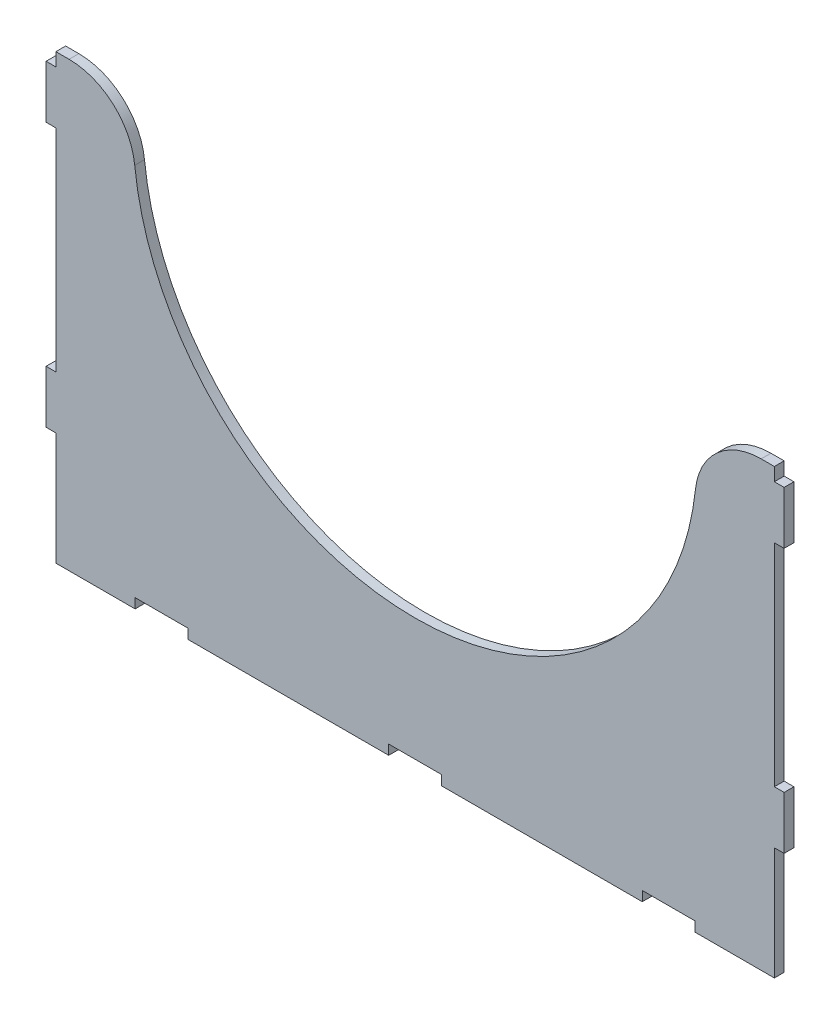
ISO-10303-21;
HEADER;
FILE_DESCRIPTION(('STEP AP214'),'2;1');
FILE_NAME('part.step','',(''),(''),'','','');
FILE_SCHEMA(('AUTOMOTIVE_DESIGN { 1 0 10303 214 1 1 1 1 }'));
ENDSEC;
DATA;
#1=APPLICATION_CONTEXT('core data for automotive mechanical design processes');
#2=APPLICATION_PROTOCOL_DEFINITION('international standard','automotive_design',2000,#1);
#3=PRODUCT_CONTEXT('',#1,'mechanical');
#4=PRODUCT('Part','Part','',(#3));
#5=PRODUCT_RELATED_PRODUCT_CATEGORY('part','',(#4));
#6=PRODUCT_DEFINITION_FORMATION('','',#4);
#7=PRODUCT_DEFINITION_CONTEXT('part definition',#1,'design');
#8=PRODUCT_DEFINITION('design','',#6,#7);
#9=PRODUCT_DEFINITION_SHAPE('','',#8);
#10=(LENGTH_UNIT() NAMED_UNIT(*) SI_UNIT(.MILLI.,.METRE.));
#11=(NAMED_UNIT(*) PLANE_ANGLE_UNIT() SI_UNIT($,.RADIAN.));
#12=(NAMED_UNIT(*) SI_UNIT($,.STERADIAN.) SOLID_ANGLE_UNIT());
#13=UNCERTAINTY_MEASURE_WITH_UNIT(LENGTH_MEASURE(1.E-05),#10,'distance_accuracy_value','');
#14=(GEOMETRIC_REPRESENTATION_CONTEXT(3) GLOBAL_UNCERTAINTY_ASSIGNED_CONTEXT((#13)) GLOBAL_UNIT_ASSIGNED_CONTEXT((#10,
#11,#12)) REPRESENTATION_CONTEXT('',''));
#15=CARTESIAN_POINT('',(0.,0.,0.));
#16=DIRECTION('',(0.,0.,1.));
#17=DIRECTION('',(1.,0.,0.));
#18=AXIS2_PLACEMENT_3D('',#15,#16,#17);
#19=CARTESIAN_POINT('',(-136.,0.,3.7));
#20=DIRECTION('',(1.,0.,0.));
#21=DIRECTION('',(0.,0.,-1.));
#22=AXIS2_PLACEMENT_3D('',#19,#20,#21);
#23=PLANE('',#22);
#24=DIRECTION('',(0.,-1.,0.));
#25=VECTOR('',#24,1.);
#26=CARTESIAN_POINT('',(-136.,0.,0.));
#27=LINE('',#26,#25);
#28=CARTESIAN_POINT('',(-136.,42.7,0.));
#29=VERTEX_POINT('',#28);
#30=CARTESIAN_POINT('',(-136.,0.,0.));
#31=VERTEX_POINT('',#30);
#32=EDGE_CURVE('E297',#29,#31,#27,.T.);
#33=ORIENTED_EDGE('',*,*,#32,.T.);
#34=DIRECTION('',(0.,0.,-1.));
#35=VECTOR('',#34,1.);
#36=CARTESIAN_POINT('',(-136.,0.,3.7));
#37=LINE('',#36,#35);
#38=CARTESIAN_POINT('',(-136.,0.,3.7));
#39=VERTEX_POINT('',#38);
#40=EDGE_CURVE('E11',#39,#31,#37,.T.);
#41=ORIENTED_EDGE('',*,*,#40,.F.);
#42=DIRECTION('',(0.,-1.,0.));
#43=VECTOR('',#42,1.);
#44=CARTESIAN_POINT('',(-136.,0.,3.7));
#45=LINE('',#44,#43);
#46=CARTESIAN_POINT('',(-136.,42.7,3.7));
#47=VERTEX_POINT('',#46);
#48=EDGE_CURVE('E367',#47,#39,#45,.T.);
#49=ORIENTED_EDGE('',*,*,#48,.F.);
#50=DIRECTION('',(0.,0.,-1.));
#51=VECTOR('',#50,1.);
#52=CARTESIAN_POINT('',(-136.,42.7,3.7));
#53=LINE('',#52,#51);
#54=EDGE_CURVE('E293',#47,#29,#53,.T.);
#55=ORIENTED_EDGE('',*,*,#54,.T.);
#56=EDGE_LOOP('',(#33,#41,#49,#55));
#57=FACE_BOUND('',#56,.T.);
#58=ADVANCED_FACE('F33',(#57),#23,.F.);
#59=CARTESIAN_POINT('',(-136.,0.,3.7));
#60=DIRECTION('',(0.,1.,0.));
#61=DIRECTION('',(0.,0.,1.));
#62=AXIS2_PLACEMENT_3D('',#59,#60,#61);
#63=PLANE('',#62);
#64=DIRECTION('',(1.,0.,0.));
#65=VECTOR('',#64,1.);
#66=CARTESIAN_POINT('',(-136.,0.,0.));
#67=LINE('',#66,#65);
#68=CARTESIAN_POINT('',(-106.,0.,0.));
#69=VERTEX_POINT('',#68);
#70=EDGE_CURVE('E300',#31,#69,#67,.T.);
#71=ORIENTED_EDGE('',*,*,#70,.T.);
#72=DIRECTION('',(0.,0.,-1.));
#73=VECTOR('',#72,1.);
#74=CARTESIAN_POINT('',(-106.,0.,3.7));
#75=LINE('',#74,#73);
#76=CARTESIAN_POINT('',(-106.,0.,3.7));
#77=VERTEX_POINT('',#76);
#78=EDGE_CURVE('E41',#77,#69,#75,.T.);
#79=ORIENTED_EDGE('',*,*,#78,.F.);
#80=DIRECTION('',(1.,0.,0.));
#81=VECTOR('',#80,1.);
#82=CARTESIAN_POINT('',(-136.,0.,3.7));
#83=LINE('',#82,#81);
#84=EDGE_CURVE('E176',#39,#77,#83,.T.);
#85=ORIENTED_EDGE('',*,*,#84,.F.);
#86=ORIENTED_EDGE('',*,*,#40,.T.);
#87=EDGE_LOOP('',(#71,#79,#85,#86));
#88=FACE_BOUND('',#87,.T.);
#89=ADVANCED_FACE('F565',(#88),#63,.F.);
#90=CARTESIAN_POINT('',(-106.,0.,3.7));
#91=DIRECTION('',(-1.,0.,0.));
#92=DIRECTION('',(0.,0.,1.));
#93=AXIS2_PLACEMENT_3D('',#90,#91,#92);
#94=PLANE('',#93);
#95=DIRECTION('',(0.,1.,0.));
#96=VECTOR('',#95,1.);
#97=CARTESIAN_POINT('',(-106.,0.,0.));
#98=LINE('',#97,#96);
#99=CARTESIAN_POINT('',(-106.,3.7,0.));
#100=VERTEX_POINT('',#99);
#101=EDGE_CURVE('E302',#69,#100,#98,.T.);
#102=ORIENTED_EDGE('',*,*,#101,.T.);
#103=DIRECTION('',(0.,0.,-1.));
#104=VECTOR('',#103,1.);
#105=CARTESIAN_POINT('',(-106.,3.7,3.7));
#106=LINE('',#105,#104);
#107=CARTESIAN_POINT('',(-106.,3.7,3.7));
#108=VERTEX_POINT('',#107);
#109=EDGE_CURVE('E458',#108,#100,#106,.T.);
#110=ORIENTED_EDGE('',*,*,#109,.F.);
#111=DIRECTION('',(0.,1.,0.));
#112=VECTOR('',#111,1.);
#113=CARTESIAN_POINT('',(-106.,0.,3.7));
#114=LINE('',#113,#112);
#115=EDGE_CURVE('E466',#77,#108,#114,.T.);
#116=ORIENTED_EDGE('',*,*,#115,.F.);
#117=ORIENTED_EDGE('',*,*,#78,.T.);
#118=EDGE_LOOP('',(#102,#110,#116,#117));
#119=FACE_BOUND('',#118,.T.);
#120=ADVANCED_FACE('F464',(#119),#94,.F.);
#121=CARTESIAN_POINT('',(-106.,3.7,3.7));
#122=DIRECTION('',(0.,1.,0.));
#123=DIRECTION('',(0.,0.,1.));
#124=AXIS2_PLACEMENT_3D('',#121,#122,#123);
#125=PLANE('',#124);
#126=DIRECTION('',(1.,0.,0.));
#127=VECTOR('',#126,1.);
#128=CARTESIAN_POINT('',(-106.,3.7,0.));
#129=LINE('',#128,#127);
#130=CARTESIAN_POINT('',(-86.,3.7,0.));
#131=VERTEX_POINT('',#130);
#132=EDGE_CURVE('E304',#100,#131,#129,.T.);
#133=ORIENTED_EDGE('',*,*,#132,.T.);
#134=DIRECTION('',(0.,0.,-1.));
#135=VECTOR('',#134,1.);
#136=CARTESIAN_POINT('',(-86.,3.7,3.7));
#137=LINE('',#136,#135);
#138=CARTESIAN_POINT('',(-86.,3.7,3.7));
#139=VERTEX_POINT('',#138);
#140=EDGE_CURVE('E455',#139,#131,#137,.T.);
#141=ORIENTED_EDGE('',*,*,#140,.F.);
#142=DIRECTION('',(1.,0.,0.));
#143=VECTOR('',#142,1.);
#144=CARTESIAN_POINT('',(-106.,3.7,3.7));
#145=LINE('',#144,#143);
#146=EDGE_CURVE('E484',#108,#139,#145,.T.);
#147=ORIENTED_EDGE('',*,*,#146,.F.);
#148=ORIENTED_EDGE('',*,*,#109,.T.);
#149=EDGE_LOOP('',(#133,#141,#147,#148));
#150=FACE_BOUND('',#149,.T.);
#151=ADVANCED_FACE('F475',(#150),#125,.F.);
#152=CARTESIAN_POINT('',(-86.,0.,3.7));
#153=DIRECTION('',(1.,0.,0.));
#154=DIRECTION('',(0.,0.,-1.));
#155=AXIS2_PLACEMENT_3D('',#152,#153,#154);
#156=PLANE('',#155);
#157=DIRECTION('',(0.,-1.,0.));
#158=VECTOR('',#157,1.);
#159=CARTESIAN_POINT('',(-86.,0.,0.));
#160=LINE('',#159,#158);
#161=CARTESIAN_POINT('',(-86.,0.,0.));
#162=VERTEX_POINT('',#161);
#163=EDGE_CURVE('E306',#131,#162,#160,.T.);
#164=ORIENTED_EDGE('',*,*,#163,.T.);
#165=DIRECTION('',(0.,0.,-1.));
#166=VECTOR('',#165,1.);
#167=CARTESIAN_POINT('',(-86.,0.,3.7));
#168=LINE('',#167,#166);
#169=CARTESIAN_POINT('',(-86.,0.,3.7));
#170=VERTEX_POINT('',#169);
#171=EDGE_CURVE('E452',#170,#162,#168,.T.);
#172=ORIENTED_EDGE('',*,*,#171,.F.);
#173=DIRECTION('',(0.,-1.,0.));
#174=VECTOR('',#173,1.);
#175=CARTESIAN_POINT('',(-86.,0.,3.7));
#176=LINE('',#175,#174);
#177=EDGE_CURVE('E481',#139,#170,#176,.T.);
#178=ORIENTED_EDGE('',*,*,#177,.F.);
#179=ORIENTED_EDGE('',*,*,#140,.T.);
#180=EDGE_LOOP('',(#164,#172,#178,#179));
#181=FACE_BOUND('',#180,.T.);
#182=ADVANCED_FACE('F479',(#181),#156,.F.);
#183=CARTESIAN_POINT('',(-10.,0.,3.7));
#184=DIRECTION('',(0.,1.,0.));
#185=DIRECTION('',(-1.,0.,0.));
#186=AXIS2_PLACEMENT_3D('',#183,#184,#185);
#187=PLANE('',#186);
#188=DIRECTION('',(1.,0.,0.));
#189=VECTOR('',#188,1.);
#190=CARTESIAN_POINT('',(-10.,0.,0.));
#191=LINE('',#190,#189);
#192=CARTESIAN_POINT('',(-10.,0.,0.));
#193=VERTEX_POINT('',#192);
#194=EDGE_CURVE('E308',#162,#193,#191,.T.);
#195=ORIENTED_EDGE('',*,*,#194,.T.);
#196=DIRECTION('',(0.,0.,-1.));
#197=VECTOR('',#196,1.);
#198=CARTESIAN_POINT('',(-10.,0.,3.7));
#199=LINE('',#198,#197);
#200=CARTESIAN_POINT('',(-10.,0.,3.7));
#201=VERTEX_POINT('',#200);
#202=EDGE_CURVE('E449',#201,#193,#199,.T.);
#203=ORIENTED_EDGE('',*,*,#202,.F.);
#204=DIRECTION('',(1.,0.,0.));
#205=VECTOR('',#204,1.);
#206=CARTESIAN_POINT('',(-10.,0.,3.7));
#207=LINE('',#206,#205);
#208=EDGE_CURVE('E483',#170,#201,#207,.T.);
#209=ORIENTED_EDGE('',*,*,#208,.F.);
#210=ORIENTED_EDGE('',*,*,#171,.T.);
#211=EDGE_LOOP('',(#195,#203,#209,#210));
#212=FACE_BOUND('',#211,.T.);
#213=ADVANCED_FACE('F578',(#212),#187,.F.);
#214=CARTESIAN_POINT('',(-10.,0.,3.7));
#215=DIRECTION('',(-1.,0.,0.));
#216=DIRECTION('',(0.,0.,1.));
#217=AXIS2_PLACEMENT_3D('',#214,#215,#216);
#218=PLANE('',#217);
#219=DIRECTION('',(0.,1.,0.));
#220=VECTOR('',#219,1.);
#221=CARTESIAN_POINT('',(-10.,0.,0.));
#222=LINE('',#221,#220);
#223=CARTESIAN_POINT('',(-10.,3.7,0.));
#224=VERTEX_POINT('',#223);
#225=EDGE_CURVE('E310',#193,#224,#222,.T.);
#226=ORIENTED_EDGE('',*,*,#225,.T.);
#227=DIRECTION('',(0.,0.,-1.));
#228=VECTOR('',#227,1.);
#229=CARTESIAN_POINT('',(-10.,3.7,3.7));
#230=LINE('',#229,#228);
#231=CARTESIAN_POINT('',(-10.,3.7,3.7));
#232=VERTEX_POINT('',#231);
#233=EDGE_CURVE('E446',#232,#224,#230,.T.);
#234=ORIENTED_EDGE('',*,*,#233,.F.);
#235=DIRECTION('',(0.,1.,0.));
#236=VECTOR('',#235,1.);
#237=CARTESIAN_POINT('',(-10.,0.,3.7));
#238=LINE('',#237,#236);
#239=EDGE_CURVE('E486',#201,#232,#238,.T.);
#240=ORIENTED_EDGE('',*,*,#239,.F.);
#241=ORIENTED_EDGE('',*,*,#202,.T.);
#242=EDGE_LOOP('',(#226,#234,#240,#241));
#243=FACE_BOUND('',#242,.T.);
#244=ADVANCED_FACE('F581',(#243),#218,.F.);
#245=CARTESIAN_POINT('',(-10.,3.7,3.7));
#246=DIRECTION('',(0.,1.,0.));
#247=DIRECTION('',(0.,0.,1.));
#248=AXIS2_PLACEMENT_3D('',#245,#246,#247);
#249=PLANE('',#248);
#250=DIRECTION('',(1.,0.,0.));
#251=VECTOR('',#250,1.);
#252=CARTESIAN_POINT('',(-10.,3.7,0.));
#253=LINE('',#252,#251);
#254=CARTESIAN_POINT('',(10.,3.7,0.));
#255=VERTEX_POINT('',#254);
#256=EDGE_CURVE('E312',#224,#255,#253,.T.);
#257=ORIENTED_EDGE('',*,*,#256,.T.);
#258=DIRECTION('',(0.,0.,-1.));
#259=VECTOR('',#258,1.);
#260=CARTESIAN_POINT('',(10.,3.7,3.7));
#261=LINE('',#260,#259);
#262=CARTESIAN_POINT('',(10.,3.7,3.7));
#263=VERTEX_POINT('',#262);
#264=EDGE_CURVE('E443',#263,#255,#261,.T.);
#265=ORIENTED_EDGE('',*,*,#264,.F.);
#266=DIRECTION('',(1.,0.,0.));
#267=VECTOR('',#266,1.);
#268=CARTESIAN_POINT('',(-10.,3.7,3.7));
#269=LINE('',#268,#267);
#270=EDGE_CURVE('E492',#232,#263,#269,.T.);
#271=ORIENTED_EDGE('',*,*,#270,.F.);
#272=ORIENTED_EDGE('',*,*,#233,.T.);
#273=EDGE_LOOP('',(#257,#265,#271,#272));
#274=FACE_BOUND('',#273,.T.);
#275=ADVANCED_FACE('F585',(#274),#249,.F.);
#276=CARTESIAN_POINT('',(10.,0.,3.7));
#277=DIRECTION('',(1.,0.,0.));
#278=DIRECTION('',(0.,0.,-1.));
#279=AXIS2_PLACEMENT_3D('',#276,#277,#278);
#280=PLANE('',#279);
#281=DIRECTION('',(0.,-1.,0.));
#282=VECTOR('',#281,1.);
#283=CARTESIAN_POINT('',(10.,0.,0.));
#284=LINE('',#283,#282);
#285=CARTESIAN_POINT('',(10.,0.,0.));
#286=VERTEX_POINT('',#285);
#287=EDGE_CURVE('E314',#255,#286,#284,.T.);
#288=ORIENTED_EDGE('',*,*,#287,.T.);
#289=DIRECTION('',(0.,0.,-1.));
#290=VECTOR('',#289,1.);
#291=CARTESIAN_POINT('',(10.,0.,3.7));
#292=LINE('',#291,#290);
#293=CARTESIAN_POINT('',(10.,0.,3.7));
#294=VERTEX_POINT('',#293);
#295=EDGE_CURVE('E440',#294,#286,#292,.T.);
#296=ORIENTED_EDGE('',*,*,#295,.F.);
#297=DIRECTION('',(0.,-1.,0.));
#298=VECTOR('',#297,1.);
#299=CARTESIAN_POINT('',(10.,0.,3.7));
#300=LINE('',#299,#298);
#301=EDGE_CURVE('E494',#263,#294,#300,.T.);
#302=ORIENTED_EDGE('',*,*,#301,.F.);
#303=ORIENTED_EDGE('',*,*,#264,.T.);
#304=EDGE_LOOP('',(#288,#296,#302,#303));
#305=FACE_BOUND('',#304,.T.);
#306=ADVANCED_FACE('F589',(#305),#280,.F.);
#307=CARTESIAN_POINT('',(10.,0.,3.7));
#308=DIRECTION('',(0.,1.,0.));
#309=DIRECTION('',(-1.,0.,0.));
#310=AXIS2_PLACEMENT_3D('',#307,#308,#309);
#311=PLANE('',#310);
#312=DIRECTION('',(1.,0.,0.));
#313=VECTOR('',#312,1.);
#314=CARTESIAN_POINT('',(10.,0.,0.));
#315=LINE('',#314,#313);
#316=CARTESIAN_POINT('',(86.,0.,0.));
#317=VERTEX_POINT('',#316);
#318=EDGE_CURVE('E316',#286,#317,#315,.T.);
#319=ORIENTED_EDGE('',*,*,#318,.T.);
#320=DIRECTION('',(0.,0.,-1.));
#321=VECTOR('',#320,1.);
#322=CARTESIAN_POINT('',(86.,0.,3.7));
#323=LINE('',#322,#321);
#324=CARTESIAN_POINT('',(86.,0.,3.7));
#325=VERTEX_POINT('',#324);
#326=EDGE_CURVE('E437',#325,#317,#323,.T.);
#327=ORIENTED_EDGE('',*,*,#326,.F.);
#328=DIRECTION('',(1.,0.,0.));
#329=VECTOR('',#328,1.);
#330=CARTESIAN_POINT('',(10.,0.,3.7));
#331=LINE('',#330,#329);
#332=EDGE_CURVE('E496',#294,#325,#331,.T.);
#333=ORIENTED_EDGE('',*,*,#332,.F.);
#334=ORIENTED_EDGE('',*,*,#295,.T.);
#335=EDGE_LOOP('',(#319,#327,#333,#334));
#336=FACE_BOUND('',#335,.T.);
#337=ADVANCED_FACE('F593',(#336),#311,.F.);
#338=CARTESIAN_POINT('',(86.,0.,3.7));
#339=DIRECTION('',(-1.,0.,0.));
#340=DIRECTION('',(0.,0.,1.));
#341=AXIS2_PLACEMENT_3D('',#338,#339,#340);
#342=PLANE('',#341);
#343=DIRECTION('',(0.,1.,0.));
#344=VECTOR('',#343,1.);
#345=CARTESIAN_POINT('',(86.,0.,0.));
#346=LINE('',#345,#344);
#347=CARTESIAN_POINT('',(86.,3.7,0.));
#348=VERTEX_POINT('',#347);
#349=EDGE_CURVE('E318',#317,#348,#346,.T.);
#350=ORIENTED_EDGE('',*,*,#349,.T.);
#351=DIRECTION('',(0.,0.,-1.));
#352=VECTOR('',#351,1.);
#353=CARTESIAN_POINT('',(86.,3.7,3.7));
#354=LINE('',#353,#352);
#355=CARTESIAN_POINT('',(86.,3.7,3.7));
#356=VERTEX_POINT('',#355);
#357=EDGE_CURVE('E434',#356,#348,#354,.T.);
#358=ORIENTED_EDGE('',*,*,#357,.F.);
#359=DIRECTION('',(0.,1.,0.));
#360=VECTOR('',#359,1.);
#361=CARTESIAN_POINT('',(86.,0.,3.7));
#362=LINE('',#361,#360);
#363=EDGE_CURVE('E498',#325,#356,#362,.T.);
#364=ORIENTED_EDGE('',*,*,#363,.F.);
#365=ORIENTED_EDGE('',*,*,#326,.T.);
#366=EDGE_LOOP('',(#350,#358,#364,#365));
#367=FACE_BOUND('',#366,.T.);
#368=ADVANCED_FACE('F597',(#367),#342,.F.);
#369=CARTESIAN_POINT('',(86.,3.7,3.7));
#370=DIRECTION('',(0.,1.,0.));
#371=DIRECTION('',(0.,0.,1.));
#372=AXIS2_PLACEMENT_3D('',#369,#370,#371);
#373=PLANE('',#372);
#374=DIRECTION('',(1.,0.,0.));
#375=VECTOR('',#374,1.);
#376=CARTESIAN_POINT('',(86.,3.7,0.));
#377=LINE('',#376,#375);
#378=CARTESIAN_POINT('',(106.,3.7,0.));
#379=VERTEX_POINT('',#378);
#380=EDGE_CURVE('E320',#348,#379,#377,.T.);
#381=ORIENTED_EDGE('',*,*,#380,.T.);
#382=DIRECTION('',(0.,0.,-1.));
#383=VECTOR('',#382,1.);
#384=CARTESIAN_POINT('',(106.,3.7,3.7));
#385=LINE('',#384,#383);
#386=CARTESIAN_POINT('',(106.,3.7,3.7));
#387=VERTEX_POINT('',#386);
#388=EDGE_CURVE('E431',#387,#379,#385,.T.);
#389=ORIENTED_EDGE('',*,*,#388,.F.);
#390=DIRECTION('',(1.,0.,0.));
#391=VECTOR('',#390,1.);
#392=CARTESIAN_POINT('',(86.,3.7,3.7));
#393=LINE('',#392,#391);
#394=EDGE_CURVE('E500',#356,#387,#393,.T.);
#395=ORIENTED_EDGE('',*,*,#394,.F.);
#396=ORIENTED_EDGE('',*,*,#357,.T.);
#397=EDGE_LOOP('',(#381,#389,#395,#396));
#398=FACE_BOUND('',#397,.T.);
#399=ADVANCED_FACE('F601',(#398),#373,.F.);
#400=CARTESIAN_POINT('',(106.,0.,3.7));
#401=DIRECTION('',(1.,0.,0.));
#402=DIRECTION('',(0.,0.,-1.));
#403=AXIS2_PLACEMENT_3D('',#400,#401,#402);
#404=PLANE('',#403);
#405=DIRECTION('',(0.,-1.,0.));
#406=VECTOR('',#405,1.);
#407=CARTESIAN_POINT('',(106.,0.,0.));
#408=LINE('',#407,#406);
#409=CARTESIAN_POINT('',(106.,0.,0.));
#410=VERTEX_POINT('',#409);
#411=EDGE_CURVE('E322',#379,#410,#408,.T.);
#412=ORIENTED_EDGE('',*,*,#411,.T.);
#413=DIRECTION('',(0.,0.,-1.));
#414=VECTOR('',#413,1.);
#415=CARTESIAN_POINT('',(106.,0.,3.7));
#416=LINE('',#415,#414);
#417=CARTESIAN_POINT('',(106.,0.,3.7));
#418=VERTEX_POINT('',#417);
#419=EDGE_CURVE('E428',#418,#410,#416,.T.);
#420=ORIENTED_EDGE('',*,*,#419,.F.);
#421=DIRECTION('',(0.,-1.,0.));
#422=VECTOR('',#421,1.);
#423=CARTESIAN_POINT('',(106.,0.,3.7));
#424=LINE('',#423,#422);
#425=EDGE_CURVE('E502',#387,#418,#424,.T.);
#426=ORIENTED_EDGE('',*,*,#425,.F.);
#427=ORIENTED_EDGE('',*,*,#388,.T.);
#428=EDGE_LOOP('',(#412,#420,#426,#427));
#429=FACE_BOUND('',#428,.T.);
#430=ADVANCED_FACE('F605',(#429),#404,.F.);
#431=CARTESIAN_POINT('',(106.,0.,3.7));
#432=DIRECTION('',(0.,1.,0.));
#433=DIRECTION('',(0.,0.,1.));
#434=AXIS2_PLACEMENT_3D('',#431,#432,#433);
#435=PLANE('',#434);
#436=DIRECTION('',(1.,0.,0.));
#437=VECTOR('',#436,1.);
#438=CARTESIAN_POINT('',(106.,0.,0.));
#439=LINE('',#438,#437);
#440=CARTESIAN_POINT('',(136.,0.,0.));
#441=VERTEX_POINT('',#440);
#442=EDGE_CURVE('E324',#410,#441,#439,.T.);
#443=ORIENTED_EDGE('',*,*,#442,.T.);
#444=DIRECTION('',(0.,0.,-1.));
#445=VECTOR('',#444,1.);
#446=CARTESIAN_POINT('',(136.,0.,3.7));
#447=LINE('',#446,#445);
#448=CARTESIAN_POINT('',(136.,0.,3.7));
#449=VERTEX_POINT('',#448);
#450=EDGE_CURVE('E425',#449,#441,#447,.T.);
#451=ORIENTED_EDGE('',*,*,#450,.F.);
#452=DIRECTION('',(1.,0.,0.));
#453=VECTOR('',#452,1.);
#454=CARTESIAN_POINT('',(106.,0.,3.7));
#455=LINE('',#454,#453);
#456=EDGE_CURVE('E504',#418,#449,#455,.T.);
#457=ORIENTED_EDGE('',*,*,#456,.F.);
#458=ORIENTED_EDGE('',*,*,#419,.T.);
#459=EDGE_LOOP('',(#443,#451,#457,#458));
#460=FACE_BOUND('',#459,.T.);
#461=ADVANCED_FACE('F609',(#460),#435,.F.);
#462=CARTESIAN_POINT('',(136.,0.,3.7));
#463=DIRECTION('',(-1.,0.,0.));
#464=DIRECTION('',(0.,0.,1.));
#465=AXIS2_PLACEMENT_3D('',#462,#463,#464);
#466=PLANE('',#465);
#467=DIRECTION('',(0.,1.,0.));
#468=VECTOR('',#467,1.);
#469=CARTESIAN_POINT('',(136.,0.,0.));
#470=LINE('',#469,#468);
#471=CARTESIAN_POINT('',(136.,42.7,0.));
#472=VERTEX_POINT('',#471);
#473=EDGE_CURVE('E326',#441,#472,#470,.T.);
#474=ORIENTED_EDGE('',*,*,#473,.T.);
#475=DIRECTION('',(0.,0.,-1.));
#476=VECTOR('',#475,1.);
#477=CARTESIAN_POINT('',(136.,42.7,3.7));
#478=LINE('',#477,#476);
#479=CARTESIAN_POINT('',(136.,42.7,3.7));
#480=VERTEX_POINT('',#479);
#481=EDGE_CURVE('E422',#480,#472,#478,.T.);
#482=ORIENTED_EDGE('',*,*,#481,.F.);
#483=DIRECTION('',(0.,1.,0.));
#484=VECTOR('',#483,1.);
#485=CARTESIAN_POINT('',(136.,0.,3.7));
#486=LINE('',#485,#484);
#487=EDGE_CURVE('E506',#449,#480,#486,.T.);
#488=ORIENTED_EDGE('',*,*,#487,.F.);
#489=ORIENTED_EDGE('',*,*,#450,.T.);
#490=EDGE_LOOP('',(#474,#482,#488,#489));
#491=FACE_BOUND('',#490,.T.);
#492=ADVANCED_FACE('F613',(#491),#466,.F.);
#493=CARTESIAN_POINT('',(136.,42.7,3.7));
#494=DIRECTION('',(0.,1.,0.));
#495=DIRECTION('',(0.,0.,1.));
#496=AXIS2_PLACEMENT_3D('',#493,#494,#495);
#497=PLANE('',#496);
#498=DIRECTION('',(1.,0.,0.));
#499=VECTOR('',#498,1.);
#500=CARTESIAN_POINT('',(136.,42.7,0.));
#501=LINE('',#500,#499);
#502=CARTESIAN_POINT('',(139.7,42.7,0.));
#503=VERTEX_POINT('',#502);
#504=EDGE_CURVE('E328',#472,#503,#501,.T.);
#505=ORIENTED_EDGE('',*,*,#504,.T.);
#506=DIRECTION('',(0.,0.,-1.));
#507=VECTOR('',#506,1.);
#508=CARTESIAN_POINT('',(139.7,42.7,3.7));
#509=LINE('',#508,#507);
#510=CARTESIAN_POINT('',(139.7,42.7,3.7));
#511=VERTEX_POINT('',#510);
#512=EDGE_CURVE('E419',#511,#503,#509,.T.);
#513=ORIENTED_EDGE('',*,*,#512,.F.);
#514=DIRECTION('',(1.,0.,0.));
#515=VECTOR('',#514,1.);
#516=CARTESIAN_POINT('',(136.,42.7,3.7));
#517=LINE('',#516,#515);
#518=EDGE_CURVE('E508',#480,#511,#517,.T.);
#519=ORIENTED_EDGE('',*,*,#518,.F.);
#520=ORIENTED_EDGE('',*,*,#481,.T.);
#521=EDGE_LOOP('',(#505,#513,#519,#520));
#522=FACE_BOUND('',#521,.T.);
#523=ADVANCED_FACE('F617',(#522),#497,.F.);
#524=CARTESIAN_POINT('',(139.7,62.7,3.7));
#525=DIRECTION('',(-1.,0.,0.));
#526=DIRECTION('',(0.,-1.,0.));
#527=AXIS2_PLACEMENT_3D('',#524,#525,#526);
#528=PLANE('',#527);
#529=DIRECTION('',(0.,1.,0.));
#530=VECTOR('',#529,1.);
#531=CARTESIAN_POINT('',(139.7,62.7,0.));
#532=LINE('',#531,#530);
#533=CARTESIAN_POINT('',(139.7,62.7,0.));
#534=VERTEX_POINT('',#533);
#535=EDGE_CURVE('E330',#503,#534,#532,.T.);
#536=ORIENTED_EDGE('',*,*,#535,.T.);
#537=DIRECTION('',(0.,0.,-1.));
#538=VECTOR('',#537,1.);
#539=CARTESIAN_POINT('',(139.7,62.7,3.7));
#540=LINE('',#539,#538);
#541=CARTESIAN_POINT('',(139.7,62.7,3.7));
#542=VERTEX_POINT('',#541);
#543=EDGE_CURVE('E416',#542,#534,#540,.T.);
#544=ORIENTED_EDGE('',*,*,#543,.F.);
#545=DIRECTION('',(0.,1.,0.));
#546=VECTOR('',#545,1.);
#547=CARTESIAN_POINT('',(139.7,62.7,3.7));
#548=LINE('',#547,#546);
#549=EDGE_CURVE('E510',#511,#542,#548,.T.);
#550=ORIENTED_EDGE('',*,*,#549,.F.);
#551=ORIENTED_EDGE('',*,*,#512,.T.);
#552=EDGE_LOOP('',(#536,#544,#550,#551));
#553=FACE_BOUND('',#552,.T.);
#554=ADVANCED_FACE('F621',(#553),#528,.F.);
#555=CARTESIAN_POINT('',(136.,62.7,3.7));
#556=DIRECTION('',(0.,-1.,0.));
#557=DIRECTION('',(0.,0.,-1.));
#558=AXIS2_PLACEMENT_3D('',#555,#556,#557);
#559=PLANE('',#558);
#560=DIRECTION('',(-1.,0.,0.));
#561=VECTOR('',#560,1.);
#562=CARTESIAN_POINT('',(136.,62.7,0.));
#563=LINE('',#562,#561);
#564=CARTESIAN_POINT('',(136.,62.7,0.));
#565=VERTEX_POINT('',#564);
#566=EDGE_CURVE('E332',#534,#565,#563,.T.);
#567=ORIENTED_EDGE('',*,*,#566,.T.);
#568=DIRECTION('',(0.,0.,-1.));
#569=VECTOR('',#568,1.);
#570=CARTESIAN_POINT('',(136.,62.7,3.7));
#571=LINE('',#570,#569);
#572=CARTESIAN_POINT('',(136.,62.7,3.7));
#573=VERTEX_POINT('',#572);
#574=EDGE_CURVE('E413',#573,#565,#571,.T.);
#575=ORIENTED_EDGE('',*,*,#574,.F.);
#576=DIRECTION('',(-1.,0.,0.));
#577=VECTOR('',#576,1.);
#578=CARTESIAN_POINT('',(136.,62.7,3.7));
#579=LINE('',#578,#577);
#580=EDGE_CURVE('E512',#542,#573,#579,.T.);
#581=ORIENTED_EDGE('',*,*,#580,.F.);
#582=ORIENTED_EDGE('',*,*,#543,.T.);
#583=EDGE_LOOP('',(#567,#575,#581,#582));
#584=FACE_BOUND('',#583,.T.);
#585=ADVANCED_FACE('F625',(#584),#559,.F.);
#586=CARTESIAN_POINT('',(136.,62.7,3.7));
#587=DIRECTION('',(-1.,0.,0.));
#588=DIRECTION('',(0.,0.,1.));
#589=AXIS2_PLACEMENT_3D('',#586,#587,#588);
#590=PLANE('',#589);
#591=DIRECTION('',(0.,1.,0.));
#592=VECTOR('',#591,1.);
#593=CARTESIAN_POINT('',(136.,62.7,0.));
#594=LINE('',#593,#592);
#595=CARTESIAN_POINT('',(136.,142.7,0.));
#596=VERTEX_POINT('',#595);
#597=EDGE_CURVE('E334',#565,#596,#594,.T.);
#598=ORIENTED_EDGE('',*,*,#597,.T.);
#599=DIRECTION('',(0.,0.,-1.));
#600=VECTOR('',#599,1.);
#601=CARTESIAN_POINT('',(136.,142.7,3.7));
#602=LINE('',#601,#600);
#603=CARTESIAN_POINT('',(136.,142.7,3.7));
#604=VERTEX_POINT('',#603);
#605=EDGE_CURVE('E410',#604,#596,#602,.T.);
#606=ORIENTED_EDGE('',*,*,#605,.F.);
#607=DIRECTION('',(0.,1.,0.));
#608=VECTOR('',#607,1.);
#609=CARTESIAN_POINT('',(136.,62.7,3.7));
#610=LINE('',#609,#608);
#611=EDGE_CURVE('E514',#573,#604,#610,.T.);
#612=ORIENTED_EDGE('',*,*,#611,.F.);
#613=ORIENTED_EDGE('',*,*,#574,.T.);
#614=EDGE_LOOP('',(#598,#606,#612,#613));
#615=FACE_BOUND('',#614,.T.);
#616=ADVANCED_FACE('F629',(#615),#590,.F.);
#617=CARTESIAN_POINT('',(139.7,142.7,3.7));
#618=DIRECTION('',(0.,1.,0.));
#619=DIRECTION('',(0.,0.,1.));
#620=AXIS2_PLACEMENT_3D('',#617,#618,#619);
#621=PLANE('',#620);
#622=DIRECTION('',(1.,0.,0.));
#623=VECTOR('',#622,1.);
#624=CARTESIAN_POINT('',(139.7,142.7,0.));
#625=LINE('',#624,#623);
#626=CARTESIAN_POINT('',(139.7,142.7,0.));
#627=VERTEX_POINT('',#626);
#628=EDGE_CURVE('E336',#596,#627,#625,.T.);
#629=ORIENTED_EDGE('',*,*,#628,.T.);
#630=DIRECTION('',(0.,0.,-1.));
#631=VECTOR('',#630,1.);
#632=CARTESIAN_POINT('',(139.7,142.7,3.7));
#633=LINE('',#632,#631);
#634=CARTESIAN_POINT('',(139.7,142.7,3.7));
#635=VERTEX_POINT('',#634);
#636=EDGE_CURVE('E407',#635,#627,#633,.T.);
#637=ORIENTED_EDGE('',*,*,#636,.F.);
#638=DIRECTION('',(1.,0.,0.));
#639=VECTOR('',#638,1.);
#640=CARTESIAN_POINT('',(139.7,142.7,3.7));
#641=LINE('',#640,#639);
#642=EDGE_CURVE('E516',#604,#635,#641,.T.);
#643=ORIENTED_EDGE('',*,*,#642,.F.);
#644=ORIENTED_EDGE('',*,*,#605,.T.);
#645=EDGE_LOOP('',(#629,#637,#643,#644));
#646=FACE_BOUND('',#645,.T.);
#647=ADVANCED_FACE('F633',(#646),#621,.F.);
#648=CARTESIAN_POINT('',(139.7,162.7,3.7));
#649=DIRECTION('',(-1.,0.,0.));
#650=DIRECTION('',(0.,-1.,0.));
#651=AXIS2_PLACEMENT_3D('',#648,#649,#650);
#652=PLANE('',#651);
#653=DIRECTION('',(0.,1.,0.));
#654=VECTOR('',#653,1.);
#655=CARTESIAN_POINT('',(139.7,162.7,0.));
#656=LINE('',#655,#654);
#657=CARTESIAN_POINT('',(139.7,162.7,0.));
#658=VERTEX_POINT('',#657);
#659=EDGE_CURVE('E338',#627,#658,#656,.T.);
#660=ORIENTED_EDGE('',*,*,#659,.T.);
#661=DIRECTION('',(0.,0.,-1.));
#662=VECTOR('',#661,1.);
#663=CARTESIAN_POINT('',(139.7,162.7,3.7));
#664=LINE('',#663,#662);
#665=CARTESIAN_POINT('',(139.7,162.7,3.7));
#666=VERTEX_POINT('',#665);
#667=EDGE_CURVE('E404',#666,#658,#664,.T.);
#668=ORIENTED_EDGE('',*,*,#667,.F.);
#669=DIRECTION('',(0.,1.,0.));
#670=VECTOR('',#669,1.);
#671=CARTESIAN_POINT('',(139.7,162.7,3.7));
#672=LINE('',#671,#670);
#673=EDGE_CURVE('E518',#635,#666,#672,.T.);
#674=ORIENTED_EDGE('',*,*,#673,.F.);
#675=ORIENTED_EDGE('',*,*,#636,.T.);
#676=EDGE_LOOP('',(#660,#668,#674,#675));
#677=FACE_BOUND('',#676,.T.);
#678=ADVANCED_FACE('F637',(#677),#652,.F.);
#679=CARTESIAN_POINT('',(139.7,162.7,3.7));
#680=DIRECTION('',(0.,-1.,0.));
#681=DIRECTION('',(0.,0.,-1.));
#682=AXIS2_PLACEMENT_3D('',#679,#680,#681);
#683=PLANE('',#682);
#684=DIRECTION('',(-1.,0.,0.));
#685=VECTOR('',#684,1.);
#686=CARTESIAN_POINT('',(139.7,162.7,0.));
#687=LINE('',#686,#685);
#688=CARTESIAN_POINT('',(136.,162.7,0.));
#689=VERTEX_POINT('',#688);
#690=EDGE_CURVE('E340',#658,#689,#687,.T.);
#691=ORIENTED_EDGE('',*,*,#690,.T.);
#692=DIRECTION('',(0.,0.,-1.));
#693=VECTOR('',#692,1.);
#694=CARTESIAN_POINT('',(136.,162.7,3.7));
#695=LINE('',#694,#693);
#696=CARTESIAN_POINT('',(136.,162.7,3.7));
#697=VERTEX_POINT('',#696);
#698=EDGE_CURVE('E401',#697,#689,#695,.T.);
#699=ORIENTED_EDGE('',*,*,#698,.F.);
#700=DIRECTION('',(-1.,0.,0.));
#701=VECTOR('',#700,1.);
#702=CARTESIAN_POINT('',(139.7,162.7,3.7));
#703=LINE('',#702,#701);
#704=EDGE_CURVE('E520',#666,#697,#703,.T.);
#705=ORIENTED_EDGE('',*,*,#704,.F.);
#706=ORIENTED_EDGE('',*,*,#667,.T.);
#707=EDGE_LOOP('',(#691,#699,#705,#706));
#708=FACE_BOUND('',#707,.T.);
#709=ADVANCED_FACE('F641',(#708),#683,.F.);
#710=CARTESIAN_POINT('',(136.,162.7,3.7));
#711=DIRECTION('',(-1.,0.,0.));
#712=DIRECTION('',(0.,0.,1.));
#713=AXIS2_PLACEMENT_3D('',#710,#711,#712);
#714=PLANE('',#713);
#715=DIRECTION('',(0.,1.,0.));
#716=VECTOR('',#715,1.);
#717=CARTESIAN_POINT('',(136.,162.7,0.));
#718=LINE('',#717,#716);
#719=CARTESIAN_POINT('',(136.,167.7,0.));
#720=VERTEX_POINT('',#719);
#721=EDGE_CURVE('E342',#689,#720,#718,.T.);
#722=ORIENTED_EDGE('',*,*,#721,.T.);
#723=DIRECTION('',(0.,0.,-1.));
#724=VECTOR('',#723,1.);
#725=CARTESIAN_POINT('',(136.,167.7,3.7));
#726=LINE('',#725,#724);
#727=CARTESIAN_POINT('',(136.,167.7,3.7));
#728=VERTEX_POINT('',#727);
#729=EDGE_CURVE('E398',#728,#720,#726,.T.);
#730=ORIENTED_EDGE('',*,*,#729,.F.);
#731=DIRECTION('',(0.,1.,0.));
#732=VECTOR('',#731,1.);
#733=CARTESIAN_POINT('',(136.,162.7,3.7));
#734=LINE('',#733,#732);
#735=EDGE_CURVE('E522',#697,#728,#734,.T.);
#736=ORIENTED_EDGE('',*,*,#735,.F.);
#737=ORIENTED_EDGE('',*,*,#698,.T.);
#738=EDGE_LOOP('',(#722,#730,#736,#737));
#739=FACE_BOUND('',#738,.T.);
#740=ADVANCED_FACE('F645',(#739),#714,.F.);
#741=CARTESIAN_POINT('',(131.,167.7,3.7));
#742=DIRECTION('',(0.,-1.,0.));
#743=DIRECTION('',(0.,0.,-1.));
#744=AXIS2_PLACEMENT_3D('',#741,#742,#743);
#745=PLANE('',#744);
#746=DIRECTION('',(-1.,0.,0.));
#747=VECTOR('',#746,1.);
#748=CARTESIAN_POINT('',(131.,167.7,0.));
#749=LINE('',#748,#747);
#750=CARTESIAN_POINT('',(131.,167.7,0.));
#751=VERTEX_POINT('',#750);
#752=EDGE_CURVE('E344',#720,#751,#749,.T.);
#753=ORIENTED_EDGE('',*,*,#752,.T.);
#754=DIRECTION('',(0.,0.,-1.));
#755=VECTOR('',#754,1.);
#756=CARTESIAN_POINT('',(131.,167.7,3.7));
#757=LINE('',#756,#755);
#758=CARTESIAN_POINT('',(131.,167.7,3.7));
#759=VERTEX_POINT('',#758);
#760=EDGE_CURVE('E395',#759,#751,#757,.T.);
#761=ORIENTED_EDGE('',*,*,#760,.F.);
#762=DIRECTION('',(-1.,0.,0.));
#763=VECTOR('',#762,1.);
#764=CARTESIAN_POINT('',(131.,167.7,3.7));
#765=LINE('',#764,#763);
#766=EDGE_CURVE('E524',#728,#759,#765,.T.);
#767=ORIENTED_EDGE('',*,*,#766,.F.);
#768=ORIENTED_EDGE('',*,*,#729,.T.);
#769=EDGE_LOOP('',(#753,#761,#767,#768));
#770=FACE_BOUND('',#769,.T.);
#771=ADVANCED_FACE('F649',(#770),#745,.F.);
#772=CARTESIAN_POINT('',(131.,142.7,3.7));
#773=DIRECTION('',(0.,0.,-1.));
#774=DIRECTION('',(-1.,0.,0.));
#775=AXIS2_PLACEMENT_3D('',#772,#773,#774);
#776=CYLINDRICAL_SURFACE('',#775,25.);
#777=CARTESIAN_POINT('',(131.,142.7,0.));
#778=DIRECTION('',(0.,0.,1.));
#779=DIRECTION('',(1.,0.,0.));
#780=AXIS2_PLACEMENT_3D('',#777,#778,#779);
#781=CIRCLE('',#780,25.);
#782=CARTESIAN_POINT('',(106.14258749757,145.366278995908,0.));
#783=VERTEX_POINT('',#782);
#784=EDGE_CURVE('E346',#751,#783,#781,.T.);
#785=ORIENTED_EDGE('',*,*,#784,.T.);
#786=DIRECTION('',(0.,0.,-1.));
#787=VECTOR('',#786,1.);
#788=CARTESIAN_POINT('',(106.14258749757,145.366278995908,3.7));
#789=LINE('',#788,#787);
#790=CARTESIAN_POINT('',(106.14258749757,145.366278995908,3.7));
#791=VERTEX_POINT('',#790);
#792=EDGE_CURVE('E392',#791,#783,#789,.T.);
#793=ORIENTED_EDGE('',*,*,#792,.F.);
#794=CARTESIAN_POINT('',(131.,142.7,3.7));
#795=DIRECTION('',(0.,0.,1.));
#796=DIRECTION('',(1.,0.,0.));
#797=AXIS2_PLACEMENT_3D('',#794,#795,#796);
#798=CIRCLE('',#797,25.);
#799=EDGE_CURVE('E526',#759,#791,#798,.T.);
#800=ORIENTED_EDGE('',*,*,#799,.F.);
#801=ORIENTED_EDGE('',*,*,#760,.T.);
#802=EDGE_LOOP('',(#785,#793,#800,#801));
#803=FACE_BOUND('',#802,.T.);
#804=ADVANCED_FACE('F653',(#803),#776,.T.);
#805=CARTESIAN_POINT('',(0.,156.751444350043,3.7));
#806=DIRECTION('',(0.,0.,-1.));
#807=DIRECTION('',(-1.,0.,0.));
#808=AXIS2_PLACEMENT_3D('',#805,#806,#807);
#809=CYLINDRICAL_SURFACE('',#808,106.751444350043);
#810=CARTESIAN_POINT('',(0.,156.751444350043,0.));
#811=DIRECTION('',(0.,0.,-1.));
#812=DIRECTION('',(-1.,0.,0.));
#813=AXIS2_PLACEMENT_3D('',#810,#811,#812);
#814=CIRCLE('',#813,106.751444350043);
#815=CARTESIAN_POINT('',(-106.14258749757,145.366278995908,0.));
#816=VERTEX_POINT('',#815);
#817=EDGE_CURVE('E348',#783,#816,#814,.T.);
#818=ORIENTED_EDGE('',*,*,#817,.T.);
#819=DIRECTION('',(0.,0.,-1.));
#820=VECTOR('',#819,1.);
#821=CARTESIAN_POINT('',(-106.14258749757,145.366278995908,3.7));
#822=LINE('',#821,#820);
#823=CARTESIAN_POINT('',(-106.14258749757,145.366278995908,3.7));
#824=VERTEX_POINT('',#823);
#825=EDGE_CURVE('E389',#824,#816,#822,.T.);
#826=ORIENTED_EDGE('',*,*,#825,.F.);
#827=CARTESIAN_POINT('',(0.,156.751444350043,3.7));
#828=DIRECTION('',(0.,0.,-1.));
#829=DIRECTION('',(-1.,0.,0.));
#830=AXIS2_PLACEMENT_3D('',#827,#828,#829);
#831=CIRCLE('',#830,106.751444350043);
#832=EDGE_CURVE('E528',#791,#824,#831,.T.);
#833=ORIENTED_EDGE('',*,*,#832,.F.);
#834=ORIENTED_EDGE('',*,*,#792,.T.);
#835=EDGE_LOOP('',(#818,#826,#833,#834));
#836=FACE_BOUND('',#835,.T.);
#837=ADVANCED_FACE('F657',(#836),#809,.F.);
#838=CARTESIAN_POINT('',(-131.,142.7,3.7));
#839=DIRECTION('',(0.,0.,-1.));
#840=DIRECTION('',(-1.,0.,0.));
#841=AXIS2_PLACEMENT_3D('',#838,#839,#840);
#842=CYLINDRICAL_SURFACE('',#841,25.);
#843=CARTESIAN_POINT('',(-131.,142.7,0.));
#844=DIRECTION('',(0.,0.,1.));
#845=DIRECTION('',(1.,0.,0.));
#846=AXIS2_PLACEMENT_3D('',#843,#844,#845);
#847=CIRCLE('',#846,25.);
#848=CARTESIAN_POINT('',(-131.,167.7,0.));
#849=VERTEX_POINT('',#848);
#850=EDGE_CURVE('E350',#816,#849,#847,.T.);
#851=ORIENTED_EDGE('',*,*,#850,.T.);
#852=DIRECTION('',(0.,0.,-1.));
#853=VECTOR('',#852,1.);
#854=CARTESIAN_POINT('',(-131.,167.7,3.7));
#855=LINE('',#854,#853);
#856=CARTESIAN_POINT('',(-131.,167.7,3.7));
#857=VERTEX_POINT('',#856);
#858=EDGE_CURVE('E386',#857,#849,#855,.T.);
#859=ORIENTED_EDGE('',*,*,#858,.F.);
#860=CARTESIAN_POINT('',(-131.,142.7,3.7));
#861=DIRECTION('',(0.,0.,1.));
#862=DIRECTION('',(1.,0.,0.));
#863=AXIS2_PLACEMENT_3D('',#860,#861,#862);
#864=CIRCLE('',#863,25.);
#865=EDGE_CURVE('E530',#824,#857,#864,.T.);
#866=ORIENTED_EDGE('',*,*,#865,.F.);
#867=ORIENTED_EDGE('',*,*,#825,.T.);
#868=EDGE_LOOP('',(#851,#859,#866,#867));
#869=FACE_BOUND('',#868,.T.);
#870=ADVANCED_FACE('F661',(#869),#842,.T.);
#871=CARTESIAN_POINT('',(-136.,167.7,3.7));
#872=DIRECTION('',(0.,-1.,0.));
#873=DIRECTION('',(0.,0.,-1.));
#874=AXIS2_PLACEMENT_3D('',#871,#872,#873);
#875=PLANE('',#874);
#876=DIRECTION('',(-1.,0.,0.));
#877=VECTOR('',#876,1.);
#878=CARTESIAN_POINT('',(-136.,167.7,0.));
#879=LINE('',#878,#877);
#880=CARTESIAN_POINT('',(-136.,167.7,0.));
#881=VERTEX_POINT('',#880);
#882=EDGE_CURVE('E352',#849,#881,#879,.T.);
#883=ORIENTED_EDGE('',*,*,#882,.T.);
#884=DIRECTION('',(0.,0.,-1.));
#885=VECTOR('',#884,1.);
#886=CARTESIAN_POINT('',(-136.,167.7,3.7));
#887=LINE('',#886,#885);
#888=CARTESIAN_POINT('',(-136.,167.7,3.7));
#889=VERTEX_POINT('',#888);
#890=EDGE_CURVE('E383',#889,#881,#887,.T.);
#891=ORIENTED_EDGE('',*,*,#890,.F.);
#892=DIRECTION('',(-1.,0.,0.));
#893=VECTOR('',#892,1.);
#894=CARTESIAN_POINT('',(-136.,167.7,3.7));
#895=LINE('',#894,#893);
#896=EDGE_CURVE('E532',#857,#889,#895,.T.);
#897=ORIENTED_EDGE('',*,*,#896,.F.);
#898=ORIENTED_EDGE('',*,*,#858,.T.);
#899=EDGE_LOOP('',(#883,#891,#897,#898));
#900=FACE_BOUND('',#899,.T.);
#901=ADVANCED_FACE('F665',(#900),#875,.F.);
#902=CARTESIAN_POINT('',(-136.,162.7,3.7));
#903=DIRECTION('',(1.,0.,0.));
#904=DIRECTION('',(0.,0.,-1.));
#905=AXIS2_PLACEMENT_3D('',#902,#903,#904);
#906=PLANE('',#905);
#907=DIRECTION('',(0.,-1.,0.));
#908=VECTOR('',#907,1.);
#909=CARTESIAN_POINT('',(-136.,162.7,0.));
#910=LINE('',#909,#908);
#911=CARTESIAN_POINT('',(-136.,162.7,0.));
#912=VERTEX_POINT('',#911);
#913=EDGE_CURVE('E354',#881,#912,#910,.T.);
#914=ORIENTED_EDGE('',*,*,#913,.T.);
#915=DIRECTION('',(0.,0.,-1.));
#916=VECTOR('',#915,1.);
#917=CARTESIAN_POINT('',(-136.,162.7,3.7));
#918=LINE('',#917,#916);
#919=CARTESIAN_POINT('',(-136.,162.7,3.7));
#920=VERTEX_POINT('',#919);
#921=EDGE_CURVE('E380',#920,#912,#918,.T.);
#922=ORIENTED_EDGE('',*,*,#921,.F.);
#923=DIRECTION('',(0.,-1.,0.));
#924=VECTOR('',#923,1.);
#925=CARTESIAN_POINT('',(-136.,162.7,3.7));
#926=LINE('',#925,#924);
#927=EDGE_CURVE('E534',#889,#920,#926,.T.);
#928=ORIENTED_EDGE('',*,*,#927,.F.);
#929=ORIENTED_EDGE('',*,*,#890,.T.);
#930=EDGE_LOOP('',(#914,#922,#928,#929));
#931=FACE_BOUND('',#930,.T.);
#932=ADVANCED_FACE('F669',(#931),#906,.F.);
#933=CARTESIAN_POINT('',(-136.,162.7,3.7));
#934=DIRECTION('',(0.,-1.,0.));
#935=DIRECTION('',(0.,0.,-1.));
#936=AXIS2_PLACEMENT_3D('',#933,#934,#935);
#937=PLANE('',#936);
#938=DIRECTION('',(-1.,0.,0.));
#939=VECTOR('',#938,1.);
#940=CARTESIAN_POINT('',(-136.,162.7,0.));
#941=LINE('',#940,#939);
#942=CARTESIAN_POINT('',(-139.7,162.7,0.));
#943=VERTEX_POINT('',#942);
#944=EDGE_CURVE('E356',#912,#943,#941,.T.);
#945=ORIENTED_EDGE('',*,*,#944,.T.);
#946=DIRECTION('',(0.,0.,-1.));
#947=VECTOR('',#946,1.);
#948=CARTESIAN_POINT('',(-139.7,162.7,3.7));
#949=LINE('',#948,#947);
#950=CARTESIAN_POINT('',(-139.7,162.7,3.7));
#951=VERTEX_POINT('',#950);
#952=EDGE_CURVE('E377',#951,#943,#949,.T.);
#953=ORIENTED_EDGE('',*,*,#952,.F.);
#954=DIRECTION('',(-1.,0.,0.));
#955=VECTOR('',#954,1.);
#956=CARTESIAN_POINT('',(-136.,162.7,3.7));
#957=LINE('',#956,#955);
#958=EDGE_CURVE('E536',#920,#951,#957,.T.);
#959=ORIENTED_EDGE('',*,*,#958,.F.);
#960=ORIENTED_EDGE('',*,*,#921,.T.);
#961=EDGE_LOOP('',(#945,#953,#959,#960));
#962=FACE_BOUND('',#961,.T.);
#963=ADVANCED_FACE('F673',(#962),#937,.F.);
#964=CARTESIAN_POINT('',(-139.7,162.7,3.7));
#965=DIRECTION('',(1.,0.,0.));
#966=DIRECTION('',(0.,1.,0.));
#967=AXIS2_PLACEMENT_3D('',#964,#965,#966);
#968=PLANE('',#967);
#969=DIRECTION('',(0.,-1.,0.));
#970=VECTOR('',#969,1.);
#971=CARTESIAN_POINT('',(-139.7,162.7,0.));
#972=LINE('',#971,#970);
#973=CARTESIAN_POINT('',(-139.7,142.7,0.));
#974=VERTEX_POINT('',#973);
#975=EDGE_CURVE('E358',#943,#974,#972,.T.);
#976=ORIENTED_EDGE('',*,*,#975,.T.);
#977=DIRECTION('',(0.,0.,-1.));
#978=VECTOR('',#977,1.);
#979=CARTESIAN_POINT('',(-139.7,142.7,3.7));
#980=LINE('',#979,#978);
#981=CARTESIAN_POINT('',(-139.7,142.7,3.7));
#982=VERTEX_POINT('',#981);
#983=EDGE_CURVE('E374',#982,#974,#980,.T.);
#984=ORIENTED_EDGE('',*,*,#983,.F.);
#985=DIRECTION('',(0.,-1.,0.));
#986=VECTOR('',#985,1.);
#987=CARTESIAN_POINT('',(-139.7,162.7,3.7));
#988=LINE('',#987,#986);
#989=EDGE_CURVE('E538',#951,#982,#988,.T.);
#990=ORIENTED_EDGE('',*,*,#989,.F.);
#991=ORIENTED_EDGE('',*,*,#952,.T.);
#992=EDGE_LOOP('',(#976,#984,#990,#991));
#993=FACE_BOUND('',#992,.T.);
#994=ADVANCED_FACE('F677',(#993),#968,.F.);
#995=CARTESIAN_POINT('',(-136.,142.7,3.7));
#996=DIRECTION('',(0.,1.,0.));
#997=DIRECTION('',(0.,0.,1.));
#998=AXIS2_PLACEMENT_3D('',#995,#996,#997);
#999=PLANE('',#998);
#1000=DIRECTION('',(1.,0.,0.));
#1001=VECTOR('',#1000,1.);
#1002=CARTESIAN_POINT('',(-136.,142.7,0.));
#1003=LINE('',#1002,#1001);
#1004=CARTESIAN_POINT('',(-136.,142.7,0.));
#1005=VERTEX_POINT('',#1004);
#1006=EDGE_CURVE('E360',#974,#1005,#1003,.T.);
#1007=ORIENTED_EDGE('',*,*,#1006,.T.);
#1008=DIRECTION('',(0.,0.,-1.));
#1009=VECTOR('',#1008,1.);
#1010=CARTESIAN_POINT('',(-136.,142.7,3.7));
#1011=LINE('',#1010,#1009);
#1012=CARTESIAN_POINT('',(-136.,142.7,3.7));
#1013=VERTEX_POINT('',#1012);
#1014=EDGE_CURVE('E371',#1013,#1005,#1011,.T.);
#1015=ORIENTED_EDGE('',*,*,#1014,.F.);
#1016=DIRECTION('',(1.,0.,0.));
#1017=VECTOR('',#1016,1.);
#1018=CARTESIAN_POINT('',(-136.,142.7,3.7));
#1019=LINE('',#1018,#1017);
#1020=EDGE_CURVE('E540',#982,#1013,#1019,.T.);
#1021=ORIENTED_EDGE('',*,*,#1020,.F.);
#1022=ORIENTED_EDGE('',*,*,#983,.T.);
#1023=EDGE_LOOP('',(#1007,#1015,#1021,#1022));
#1024=FACE_BOUND('',#1023,.T.);
#1025=ADVANCED_FACE('F546',(#1024),#999,.F.);
#1026=CARTESIAN_POINT('',(-136.,62.7,3.7));
#1027=DIRECTION('',(1.,0.,0.));
#1028=DIRECTION('',(0.,0.,-1.));
#1029=AXIS2_PLACEMENT_3D('',#1026,#1027,#1028);
#1030=PLANE('',#1029);
#1031=DIRECTION('',(0.,-1.,0.));
#1032=VECTOR('',#1031,1.);
#1033=CARTESIAN_POINT('',(-136.,62.7,0.));
#1034=LINE('',#1033,#1032);
#1035=CARTESIAN_POINT('',(-136.,62.7,0.));
#1036=VERTEX_POINT('',#1035);
#1037=EDGE_CURVE('E362',#1005,#1036,#1034,.T.);
#1038=ORIENTED_EDGE('',*,*,#1037,.T.);
#1039=DIRECTION('',(0.,0.,-1.));
#1040=VECTOR('',#1039,1.);
#1041=CARTESIAN_POINT('',(-136.,62.7,3.7));
#1042=LINE('',#1041,#1040);
#1043=CARTESIAN_POINT('',(-136.,62.7,3.7));
#1044=VERTEX_POINT('',#1043);
#1045=EDGE_CURVE('E288',#1044,#1036,#1042,.T.);
#1046=ORIENTED_EDGE('',*,*,#1045,.F.);
#1047=DIRECTION('',(0.,-1.,0.));
#1048=VECTOR('',#1047,1.);
#1049=CARTESIAN_POINT('',(-136.,62.7,3.7));
#1050=LINE('',#1049,#1048);
#1051=EDGE_CURVE('E279',#1013,#1044,#1050,.T.);
#1052=ORIENTED_EDGE('',*,*,#1051,.F.);
#1053=ORIENTED_EDGE('',*,*,#1014,.T.);
#1054=EDGE_LOOP('',(#1038,#1046,#1052,#1053));
#1055=FACE_BOUND('',#1054,.T.);
#1056=ADVANCED_FACE('F550',(#1055),#1030,.F.);
#1057=CARTESIAN_POINT('',(-139.7,62.7,3.7));
#1058=DIRECTION('',(0.,-1.,0.));
#1059=DIRECTION('',(0.,0.,-1.));
#1060=AXIS2_PLACEMENT_3D('',#1057,#1058,#1059);
#1061=PLANE('',#1060);
#1062=DIRECTION('',(-1.,0.,0.));
#1063=VECTOR('',#1062,1.);
#1064=CARTESIAN_POINT('',(-139.7,62.7,0.));
#1065=LINE('',#1064,#1063);
#1066=CARTESIAN_POINT('',(-139.7,62.7,0.));
#1067=VERTEX_POINT('',#1066);
#1068=EDGE_CURVE('E287',#1036,#1067,#1065,.T.);
#1069=ORIENTED_EDGE('',*,*,#1068,.T.);
#1070=DIRECTION('',(0.,0.,-1.));
#1071=VECTOR('',#1070,1.);
#1072=CARTESIAN_POINT('',(-139.7,62.7,3.7));
#1073=LINE('',#1072,#1071);
#1074=CARTESIAN_POINT('',(-139.7,62.7,3.7));
#1075=VERTEX_POINT('',#1074);
#1076=EDGE_CURVE('E284',#1075,#1067,#1073,.T.);
#1077=ORIENTED_EDGE('',*,*,#1076,.F.);
#1078=DIRECTION('',(-1.,0.,0.));
#1079=VECTOR('',#1078,1.);
#1080=CARTESIAN_POINT('',(-139.7,62.7,3.7));
#1081=LINE('',#1080,#1079);
#1082=EDGE_CURVE('E273',#1044,#1075,#1081,.T.);
#1083=ORIENTED_EDGE('',*,*,#1082,.F.);
#1084=ORIENTED_EDGE('',*,*,#1045,.T.);
#1085=EDGE_LOOP('',(#1069,#1077,#1083,#1084));
#1086=FACE_BOUND('',#1085,.T.);
#1087=ADVANCED_FACE('F285',(#1086),#1061,.F.);
#1088=CARTESIAN_POINT('',(-139.7,62.7,3.7));
#1089=DIRECTION('',(1.,0.,0.));
#1090=DIRECTION('',(0.,1.,0.));
#1091=AXIS2_PLACEMENT_3D('',#1088,#1089,#1090);
#1092=PLANE('',#1091);
#1093=DIRECTION('',(0.,-1.,0.));
#1094=VECTOR('',#1093,1.);
#1095=CARTESIAN_POINT('',(-139.7,62.7,0.));
#1096=LINE('',#1095,#1094);
#1097=CARTESIAN_POINT('',(-139.7,42.7,0.));
#1098=VERTEX_POINT('',#1097);
#1099=EDGE_CURVE('E162',#1067,#1098,#1096,.T.);
#1100=ORIENTED_EDGE('',*,*,#1099,.T.);
#1101=DIRECTION('',(0.,0.,-1.));
#1102=VECTOR('',#1101,1.);
#1103=CARTESIAN_POINT('',(-139.7,42.7,3.7));
#1104=LINE('',#1103,#1102);
#1105=CARTESIAN_POINT('',(-139.7,42.7,3.7));
#1106=VERTEX_POINT('',#1105);
#1107=EDGE_CURVE('E289',#1106,#1098,#1104,.T.);
#1108=ORIENTED_EDGE('',*,*,#1107,.F.);
#1109=DIRECTION('',(0.,-1.,0.));
#1110=VECTOR('',#1109,1.);
#1111=CARTESIAN_POINT('',(-139.7,62.7,3.7));
#1112=LINE('',#1111,#1110);
#1113=EDGE_CURVE('E277',#1075,#1106,#1112,.T.);
#1114=ORIENTED_EDGE('',*,*,#1113,.F.);
#1115=ORIENTED_EDGE('',*,*,#1076,.T.);
#1116=EDGE_LOOP('',(#1100,#1108,#1114,#1115));
#1117=FACE_BOUND('',#1116,.T.);
#1118=ADVANCED_FACE('F291',(#1117),#1092,.F.);
#1119=CARTESIAN_POINT('',(-139.7,42.7,3.7));
#1120=DIRECTION('',(0.,1.,0.));
#1121=DIRECTION('',(0.,0.,1.));
#1122=AXIS2_PLACEMENT_3D('',#1119,#1120,#1121);
#1123=PLANE('',#1122);
#1124=DIRECTION('',(1.,0.,0.));
#1125=VECTOR('',#1124,1.);
#1126=CARTESIAN_POINT('',(-139.7,42.7,0.));
#1127=LINE('',#1126,#1125);
#1128=EDGE_CURVE('E168',#1098,#29,#1127,.T.);
#1129=ORIENTED_EDGE('',*,*,#1128,.T.);
#1130=ORIENTED_EDGE('',*,*,#54,.F.);
#1131=DIRECTION('',(1.,0.,0.));
#1132=VECTOR('',#1131,1.);
#1133=CARTESIAN_POINT('',(-139.7,42.7,3.7));
#1134=LINE('',#1133,#1132);
#1135=EDGE_CURVE('E49',#1106,#47,#1134,.T.);
#1136=ORIENTED_EDGE('',*,*,#1135,.F.);
#1137=ORIENTED_EDGE('',*,*,#1107,.T.);
#1138=EDGE_LOOP('',(#1129,#1130,#1136,#1137));
#1139=FACE_BOUND('',#1138,.T.);
#1140=ADVANCED_FACE('F554',(#1139),#1123,.F.);
#1141=CARTESIAN_POINT('',(-131.,142.7,3.7));
#1142=DIRECTION('',(0.,0.,1.));
#1143=DIRECTION('',(1.,0.,0.));
#1144=AXIS2_PLACEMENT_3D('',#1141,#1142,#1143);
#1145=PLANE('',#1144);
#1146=ORIENTED_EDGE('',*,*,#48,.T.);
#1147=ORIENTED_EDGE('',*,*,#84,.T.);
#1148=ORIENTED_EDGE('',*,*,#115,.T.);
#1149=ORIENTED_EDGE('',*,*,#146,.T.);
#1150=ORIENTED_EDGE('',*,*,#177,.T.);
#1151=ORIENTED_EDGE('',*,*,#208,.T.);
#1152=ORIENTED_EDGE('',*,*,#239,.T.);
#1153=ORIENTED_EDGE('',*,*,#270,.T.);
#1154=ORIENTED_EDGE('',*,*,#301,.T.);
#1155=ORIENTED_EDGE('',*,*,#332,.T.);
#1156=ORIENTED_EDGE('',*,*,#363,.T.);
#1157=ORIENTED_EDGE('',*,*,#394,.T.);
#1158=ORIENTED_EDGE('',*,*,#425,.T.);
#1159=ORIENTED_EDGE('',*,*,#456,.T.);
#1160=ORIENTED_EDGE('',*,*,#487,.T.);
#1161=ORIENTED_EDGE('',*,*,#518,.T.);
#1162=ORIENTED_EDGE('',*,*,#549,.T.);
#1163=ORIENTED_EDGE('',*,*,#580,.T.);
#1164=ORIENTED_EDGE('',*,*,#611,.T.);
#1165=ORIENTED_EDGE('',*,*,#642,.T.);
#1166=ORIENTED_EDGE('',*,*,#673,.T.);
#1167=ORIENTED_EDGE('',*,*,#704,.T.);
#1168=ORIENTED_EDGE('',*,*,#735,.T.);
#1169=ORIENTED_EDGE('',*,*,#766,.T.);
#1170=ORIENTED_EDGE('',*,*,#799,.T.);
#1171=ORIENTED_EDGE('',*,*,#832,.T.);
#1172=ORIENTED_EDGE('',*,*,#865,.T.);
#1173=ORIENTED_EDGE('',*,*,#896,.T.);
#1174=ORIENTED_EDGE('',*,*,#927,.T.);
#1175=ORIENTED_EDGE('',*,*,#958,.T.);
#1176=ORIENTED_EDGE('',*,*,#989,.T.);
#1177=ORIENTED_EDGE('',*,*,#1020,.T.);
#1178=ORIENTED_EDGE('',*,*,#1051,.T.);
#1179=ORIENTED_EDGE('',*,*,#1082,.T.);
#1180=ORIENTED_EDGE('',*,*,#1113,.T.);
#1181=ORIENTED_EDGE('',*,*,#1135,.T.);
#1182=EDGE_LOOP('',(#1146,#1147,#1148,#1149,#1150,#1151,#1152,#1153,#1154,#1155,#1156,#1157,
#1158,#1159,#1160,#1161,#1162,#1163,#1164,#1165,#1166,#1167,#1168,#1169,#1170,#1171,#1172,#1173,
#1174,#1175,#1176,#1177,#1178,#1179,#1180,#1181));
#1183=FACE_BOUND('',#1182,.T.);
#1184=ADVANCED_FACE('F275',(#1183),#1145,.T.);
#1185=CARTESIAN_POINT('',(-131.,142.7,0.));
#1186=DIRECTION('',(0.,0.,1.));
#1187=DIRECTION('',(1.,0.,0.));
#1188=AXIS2_PLACEMENT_3D('',#1185,#1186,#1187);
#1189=PLANE('',#1188);
#1190=ORIENTED_EDGE('',*,*,#32,.F.);
#1191=ORIENTED_EDGE('',*,*,#1128,.F.);
#1192=ORIENTED_EDGE('',*,*,#1099,.F.);
#1193=ORIENTED_EDGE('',*,*,#1068,.F.);
#1194=ORIENTED_EDGE('',*,*,#1037,.F.);
#1195=ORIENTED_EDGE('',*,*,#1006,.F.);
#1196=ORIENTED_EDGE('',*,*,#975,.F.);
#1197=ORIENTED_EDGE('',*,*,#944,.F.);
#1198=ORIENTED_EDGE('',*,*,#913,.F.);
#1199=ORIENTED_EDGE('',*,*,#882,.F.);
#1200=ORIENTED_EDGE('',*,*,#850,.F.);
#1201=ORIENTED_EDGE('',*,*,#817,.F.);
#1202=ORIENTED_EDGE('',*,*,#784,.F.);
#1203=ORIENTED_EDGE('',*,*,#752,.F.);
#1204=ORIENTED_EDGE('',*,*,#721,.F.);
#1205=ORIENTED_EDGE('',*,*,#690,.F.);
#1206=ORIENTED_EDGE('',*,*,#659,.F.);
#1207=ORIENTED_EDGE('',*,*,#628,.F.);
#1208=ORIENTED_EDGE('',*,*,#597,.F.);
#1209=ORIENTED_EDGE('',*,*,#566,.F.);
#1210=ORIENTED_EDGE('',*,*,#535,.F.);
#1211=ORIENTED_EDGE('',*,*,#504,.F.);
#1212=ORIENTED_EDGE('',*,*,#473,.F.);
#1213=ORIENTED_EDGE('',*,*,#442,.F.);
#1214=ORIENTED_EDGE('',*,*,#411,.F.);
#1215=ORIENTED_EDGE('',*,*,#380,.F.);
#1216=ORIENTED_EDGE('',*,*,#349,.F.);
#1217=ORIENTED_EDGE('',*,*,#318,.F.);
#1218=ORIENTED_EDGE('',*,*,#287,.F.);
#1219=ORIENTED_EDGE('',*,*,#256,.F.);
#1220=ORIENTED_EDGE('',*,*,#225,.F.);
#1221=ORIENTED_EDGE('',*,*,#194,.F.);
#1222=ORIENTED_EDGE('',*,*,#163,.F.);
#1223=ORIENTED_EDGE('',*,*,#132,.F.);
#1224=ORIENTED_EDGE('',*,*,#101,.F.);
#1225=ORIENTED_EDGE('',*,*,#70,.F.);
#1226=EDGE_LOOP('',(#1190,#1191,#1192,#1193,#1194,#1195,#1196,#1197,#1198,#1199,#1200,#1201,
#1202,#1203,#1204,#1205,#1206,#1207,#1208,#1209,#1210,#1211,#1212,#1213,#1214,#1215,#1216,#1217,
#1218,#1219,#1220,#1221,#1222,#1223,#1224,#1225));
#1227=FACE_BOUND('',#1226,.T.);
#1228=ADVANCED_FACE('F470',(#1227),#1189,.F.);
#1229=CLOSED_SHELL('',(#58,#89,#120,#151,#182,#213,#244,#275,#306,#337,#368,#399,#430,#461,#492,
#523,#554,#585,#616,#647,#678,#709,#740,#771,#804,#837,#870,#901,#932,#963,#994,#1025,#1056,
#1087,#1118,#1140,#1184,#1228));
#1230=MANIFOLD_SOLID_BREP('B2',#1229);
#1231=ADVANCED_BREP_SHAPE_REPRESENTATION('',(#18,#1230),#14);
#1232=SHAPE_DEFINITION_REPRESENTATION(#9,#1231);
ENDSEC;
END-ISO-10303-21;
